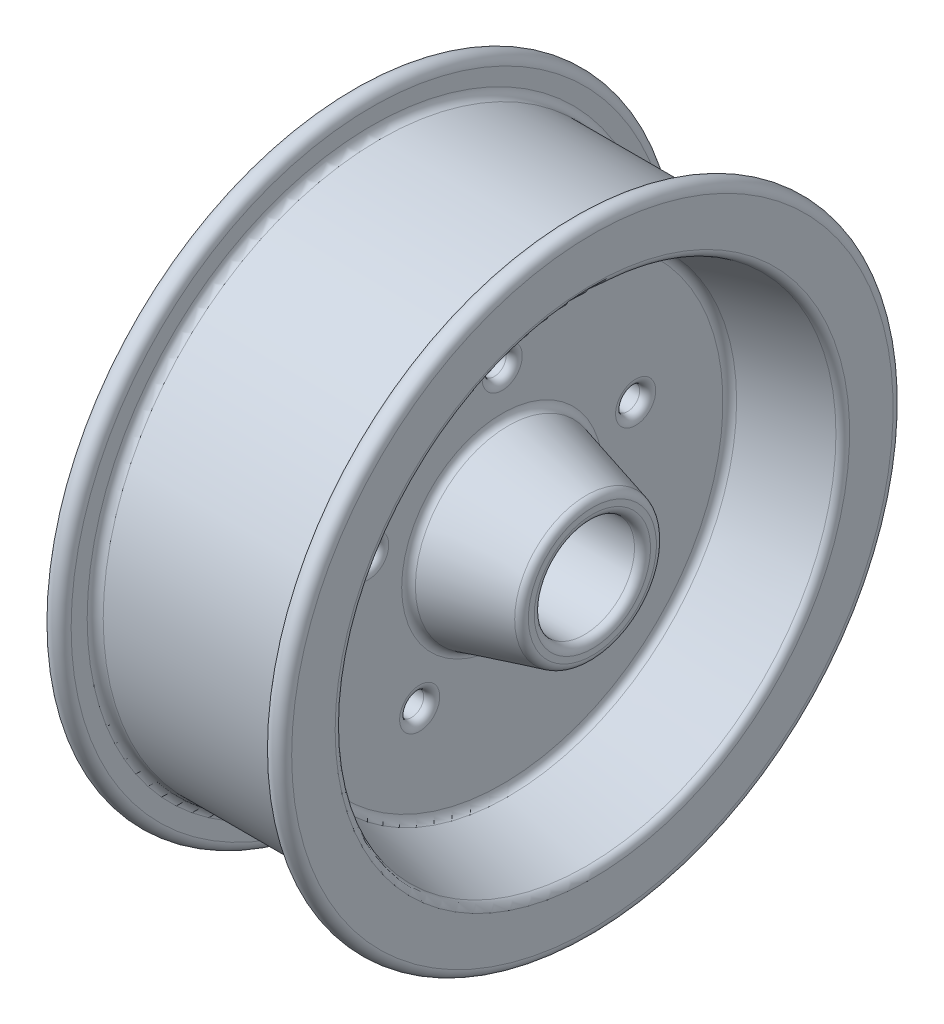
from build123d import *

# Parameters (mm, degrees)
SKETCH2_R          = 3.81
CUT_EXTRUDE2_DEPTH = 148.115947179
FILLET1_R          = 2.54


with BuildPart() as part:
    # Sketch1 → Revolve1 (revolve)
    with BuildSketch(Plane.XY, mode=Mode.PRIVATE) as revolve1_sk:
        with BuildLine():
            Line((35.56, 15.875), (-35.56, 15.875))
            ThreePointArc((-35.56, 15.875), (-37.356051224, 16.618948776), (-38.1, 18.415))
            Line((-38.1, 18.415), (-38.1, 20.275989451))
            ThreePointArc((-38.1, 20.275989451), (-37.575117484, 21.82224348), (-36.217400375, 22.729441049))
            Line((-36.217400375, 22.729441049), (-11.407599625, 29.377207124))
            ThreePointArc((-11.407599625, 29.377207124), (-10.049882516, 30.284404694), (-9.525, 31.830658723))
            Line((-9.525, 31.830658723), (-9.525, 69.921741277))
            ThreePointArc((-9.525, 69.921741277), (-10.049882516, 71.467995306), (-11.407599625, 72.375192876))
            Line((-11.407599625, 72.375192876), (-36.217400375, 79.022958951))
            ThreePointArc((-36.217400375, 79.022958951), (-37.575117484, 79.93015652), (-38.1, 81.476410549))
            Line((-38.1, 81.476410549), (-38.1, 95.25))
            ThreePointArc((-38.1, 95.25), (-34.925, 98.425), (-31.75, 95.25))
            Line((-31.75, 95.25), (-31.75, 90.17))
            ThreePointArc((-31.75, 90.17), (-31.006051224, 88.373948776), (-29.21, 87.63))
            Line((-29.21, 87.63), (29.21, 87.63))
            ThreePointArc((29.21, 87.63), (31.006051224, 88.373948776), (31.75, 90.17))
            Line((31.75, 90.17), (31.75, 95.25))
            ThreePointArc((31.75, 95.25), (34.925, 98.425), (38.1, 95.25))
            Line((38.1, 95.25), (38.1, 81.476410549))
            ThreePointArc((38.1, 81.476410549), (37.575117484, 79.93015652), (36.217400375, 79.022958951))
            Line((36.217400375, 79.022958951), (11.407599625, 72.375192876))
            ThreePointArc((11.407599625, 72.375192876), (10.049882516, 71.467995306), (9.525, 69.921741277))
            Line((9.525, 69.921741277), (9.525, 31.830658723))
            ThreePointArc((9.525, 31.830658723), (10.049882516, 30.284404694), (11.407599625, 29.377207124))
            Line((11.407599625, 29.377207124), (36.217400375, 22.729441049))
            ThreePointArc((36.217400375, 22.729441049), (37.575117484, 21.82224348), (38.1, 20.275989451))
            Line((38.1, 20.275989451), (38.1, 18.415))
            ThreePointArc((38.1, 18.415), (37.356051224, 16.618948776), (35.56, 15.875))
        make_face()
    revolve(revolve1_sk.sketch.rotate(Axis((-47.316433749, 0, 0), (1, 0, 0)), 90), axis=Axis((-47.316433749, 0, 0), (1, 0, 0)))

    # Sketch2 → Cut-Extrude2 (cut, through all)
    with BuildSketch(Plane(origin=(9.525, 0, 0), x_dir=(0, 0, -1), z_dir=(1, 0, 0))):
        with Locations((0, 44.45)):
            Circle(SKETCH2_R)
        with Locations((42.274462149, 13.7358054)):
            Circle(SKETCH2_R)
        with Locations((26.127054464, -35.9608054)):
            Circle(SKETCH2_R)
        with Locations((-26.127054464, -35.9608054)):
            Circle(SKETCH2_R)
        with Locations((-42.274462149, 13.7358054)):
            Circle(SKETCH2_R)
    extrude(amount=-CUT_EXTRUDE2_DEPTH, mode=Mode.SUBTRACT)

    # Fillet1
    fillet1_edges = [part.edges().sort_by_distance(p)[0] for p in [
        (-9.525, 44.45, 3.81),
        (9.525, 44.45, 3.81),
        (-9.525, 13.7358054, -38.464462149),
        (9.525, 13.7358054, -38.464462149),
        (-9.525, -35.9608054, -22.317054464),
        (9.525, -35.9608054, -22.317054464),
        (-9.525, -35.9608054, 29.937054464),
        (9.525, -35.9608054, 29.937054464),
        (-9.525, 13.7358054, 46.084462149),
        (9.525, 13.7358054, 46.084462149),
    ]]
    fillet(fillet1_edges, radius=FILLET1_R)


solid = part.part
